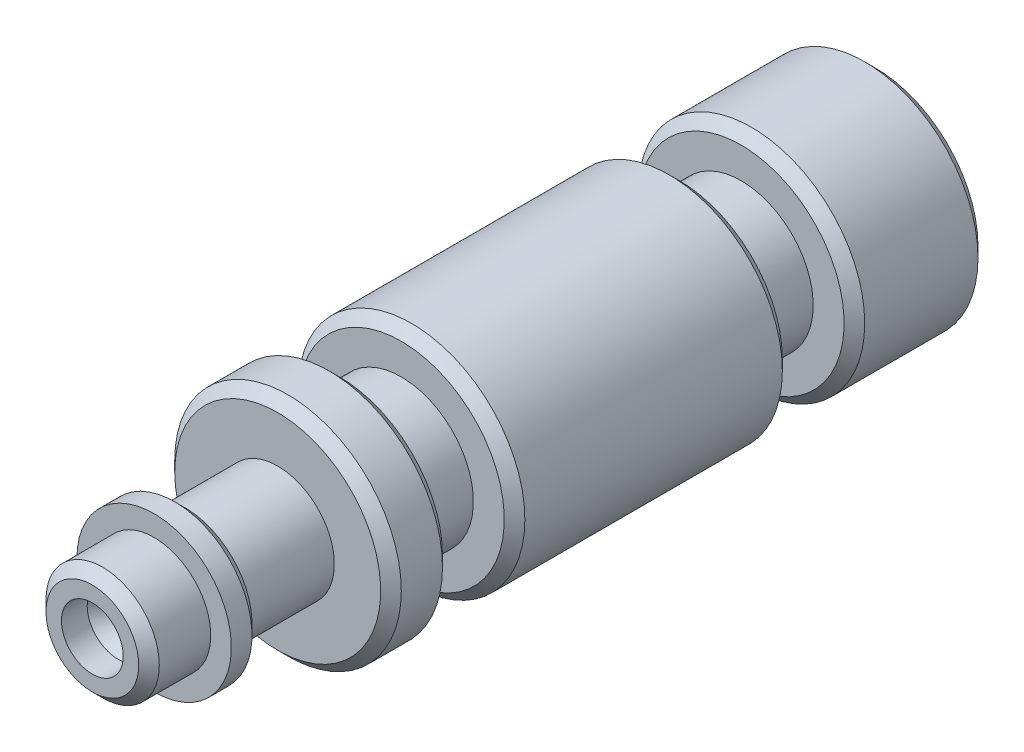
ISO-10303-21;
HEADER;
FILE_DESCRIPTION(('STEP AP214'),'2;1');
FILE_NAME('part.step','',(''),(''),'','','');
FILE_SCHEMA(('AUTOMOTIVE_DESIGN { 1 0 10303 214 1 1 1 1 }'));
ENDSEC;
DATA;
#1=APPLICATION_CONTEXT('core data for automotive mechanical design processes');
#2=APPLICATION_PROTOCOL_DEFINITION('international standard','automotive_design',2000,#1);
#3=PRODUCT_CONTEXT('',#1,'mechanical');
#4=PRODUCT('Part','Part','',(#3));
#5=PRODUCT_RELATED_PRODUCT_CATEGORY('part','',(#4));
#6=PRODUCT_DEFINITION_FORMATION('','',#4);
#7=PRODUCT_DEFINITION_CONTEXT('part definition',#1,'design');
#8=PRODUCT_DEFINITION('design','',#6,#7);
#9=PRODUCT_DEFINITION_SHAPE('','',#8);
#10=(LENGTH_UNIT() NAMED_UNIT(*) SI_UNIT(.MILLI.,.METRE.));
#11=(NAMED_UNIT(*) PLANE_ANGLE_UNIT() SI_UNIT($,.RADIAN.));
#12=(NAMED_UNIT(*) SI_UNIT($,.STERADIAN.) SOLID_ANGLE_UNIT());
#13=UNCERTAINTY_MEASURE_WITH_UNIT(LENGTH_MEASURE(1.E-05),#10,'distance_accuracy_value','');
#14=(GEOMETRIC_REPRESENTATION_CONTEXT(3) GLOBAL_UNCERTAINTY_ASSIGNED_CONTEXT((#13)) GLOBAL_UNIT_ASSIGNED_CONTEXT((#10,
#11,#12)) REPRESENTATION_CONTEXT('',''));
#15=CARTESIAN_POINT('',(0.,0.,0.));
#16=DIRECTION('',(0.,0.,1.));
#17=DIRECTION('',(1.,0.,0.));
#18=AXIS2_PLACEMENT_3D('',#15,#16,#17);
#19=CARTESIAN_POINT('',(0.,0.,38.));
#20=DIRECTION('',(0.,0.,-1.));
#21=DIRECTION('',(-1.,0.,0.));
#22=AXIS2_PLACEMENT_3D('',#19,#20,#21);
#23=CYLINDRICAL_SURFACE('',#22,5.5);
#24=CARTESIAN_POINT('',(0.,0.,10.));
#25=DIRECTION('',(0.,0.,1.));
#26=DIRECTION('',(1.,0.,0.));
#27=AXIS2_PLACEMENT_3D('',#24,#25,#26);
#28=CIRCLE('',#27,5.5);
#29=CARTESIAN_POINT('',(5.5,0.,10.));
#30=VERTEX_POINT('',#29);
#31=EDGE_CURVE('E43',#30,#30,#28,.T.);
#32=ORIENTED_EDGE('',*,*,#31,.T.);
#33=EDGE_LOOP('',(#32));
#34=FACE_BOUND('',#33,.T.);
#35=CARTESIAN_POINT('',(0.,0.,22.5));
#36=DIRECTION('',(0.,0.,-1.));
#37=DIRECTION('',(-1.,0.,0.));
#38=AXIS2_PLACEMENT_3D('',#35,#36,#37);
#39=CIRCLE('',#38,5.5);
#40=CARTESIAN_POINT('',(-5.5,0.,22.5));
#41=VERTEX_POINT('',#40);
#42=EDGE_CURVE('E46',#41,#41,#39,.T.);
#43=ORIENTED_EDGE('',*,*,#42,.T.);
#44=EDGE_LOOP('',(#43));
#45=FACE_BOUND('',#44,.T.);
#46=ADVANCED_FACE('F23',(#34,#45),#23,.T.);
#47=CARTESIAN_POINT('',(0.,0.,0.500000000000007));
#48=DIRECTION('',(0.,0.,1.));
#49=DIRECTION('',(1.,0.,0.));
#50=AXIS2_PLACEMENT_3D('',#47,#48,#49);
#51=CIRCLE('',#50,5.5);
#52=CARTESIAN_POINT('',(5.5,0.,0.500000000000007));
#53=VERTEX_POINT('',#52);
#54=EDGE_CURVE('E58',#53,#53,#51,.T.);
#55=ORIENTED_EDGE('',*,*,#54,.T.);
#56=EDGE_LOOP('',(#55));
#57=FACE_BOUND('',#56,.T.);
#58=CARTESIAN_POINT('',(0.,0.,5.99999999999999));
#59=DIRECTION('',(0.,0.,-1.));
#60=DIRECTION('',(-1.,0.,0.));
#61=AXIS2_PLACEMENT_3D('',#58,#59,#60);
#62=CIRCLE('',#61,5.5);
#63=CARTESIAN_POINT('',(-5.5,0.,5.99999999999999));
#64=VERTEX_POINT('',#63);
#65=EDGE_CURVE('E61',#64,#64,#62,.T.);
#66=ORIENTED_EDGE('',*,*,#65,.T.);
#67=EDGE_LOOP('',(#66));
#68=FACE_BOUND('',#67,.T.);
#69=ADVANCED_FACE('F145',(#57,#68),#23,.T.);
#70=CARTESIAN_POINT('',(0.,0.,0.));
#71=DIRECTION('',(0.,0.,1.));
#72=DIRECTION('',(1.,0.,0.));
#73=AXIS2_PLACEMENT_3D('',#70,#71,#72);
#74=PLANE('',#73);
#75=CARTESIAN_POINT('',(0.,0.,0.));
#76=DIRECTION('',(0.,0.,1.));
#77=DIRECTION('',(1.,0.,0.));
#78=AXIS2_PLACEMENT_3D('',#75,#76,#77);
#79=CIRCLE('',#78,5.);
#80=CARTESIAN_POINT('',(5.,0.,0.));
#81=VERTEX_POINT('',#80);
#82=EDGE_CURVE('E55',#81,#81,#79,.F.);
#83=ORIENTED_EDGE('',*,*,#82,.T.);
#84=EDGE_LOOP('',(#83));
#85=FACE_BOUND('',#84,.T.);
#86=CARTESIAN_POINT('',(0.,0.,0.));
#87=DIRECTION('',(0.,0.,-1.));
#88=DIRECTION('',(-1.,0.,0.));
#89=AXIS2_PLACEMENT_3D('',#86,#87,#88);
#90=CIRCLE('',#89,4.5);
#91=CARTESIAN_POINT('',(-4.5,0.,0.));
#92=VERTEX_POINT('',#91);
#93=EDGE_CURVE('E76',#92,#92,#90,.T.);
#94=ORIENTED_EDGE('',*,*,#93,.F.);
#95=EDGE_LOOP('',(#94));
#96=FACE_BOUND('',#95,.T.);
#97=ADVANCED_FACE('F151',(#85,#96),#74,.F.);
#98=CARTESIAN_POINT('',(0.,0.,3.));
#99=DIRECTION('',(0.,0.,-1.));
#100=DIRECTION('',(0.,1.,0.));
#101=AXIS2_PLACEMENT_3D('',#98,#99,#100);
#102=SPHERICAL_SURFACE('',#101,3.);
#103=CARTESIAN_POINT('',(0.,0.,5.15525339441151));
#104=DIRECTION('',(0.,0.,-1.));
#105=DIRECTION('',(-1.,0.,0.));
#106=AXIS2_PLACEMENT_3D('',#103,#104,#105);
#107=CIRCLE('',#106,2.08683559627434);
#108=CARTESIAN_POINT('',(-2.08683559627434,0.,5.15525339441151));
#109=VERTEX_POINT('',#108);
#110=EDGE_CURVE('E73',#109,#109,#107,.T.);
#111=ORIENTED_EDGE('',*,*,#110,.T.);
#112=EDGE_LOOP('',(#111));
#113=FACE_BOUND('',#112,.T.);
#114=ADVANCED_FACE('F209',(#113),#102,.F.);
#115=CARTESIAN_POINT('',(0.,0.,-0.592088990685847));
#116=DIRECTION('',(0.,0.,-1.));
#117=DIRECTION('',(-1.,0.,0.));
#118=AXIS2_PLACEMENT_3D('',#115,#116,#117);
#119=DEGENERATE_TOROIDAL_SURFACE('',#118,3.4780593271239,8.,.F.);
#120=ORIENTED_EDGE('',*,*,#110,.F.);
#121=EDGE_LOOP('',(#120));
#122=FACE_BOUND('',#121,.T.);
#123=ORIENTED_EDGE('',*,*,#93,.T.);
#124=EDGE_LOOP('',(#123));
#125=FACE_BOUND('',#124,.T.);
#126=ADVANCED_FACE('F205',(#122,#125),#119,.T.);
#127=CARTESIAN_POINT('',(0.,5.5,6.5));
#128=DIRECTION('',(0.,0.,-1.));
#129=DIRECTION('',(-1.,0.,0.));
#130=AXIS2_PLACEMENT_3D('',#127,#128,#129);
#131=PLANE('',#130);
#132=CARTESIAN_POINT('',(0.,0.,6.5));
#133=DIRECTION('',(0.,0.,-1.));
#134=DIRECTION('',(-1.,0.,0.));
#135=AXIS2_PLACEMENT_3D('',#132,#133,#134);
#136=CIRCLE('',#135,4.99999999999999);
#137=CARTESIAN_POINT('',(-4.99999999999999,0.,6.5));
#138=VERTEX_POINT('',#137);
#139=EDGE_CURVE('E52',#138,#138,#136,.F.);
#140=ORIENTED_EDGE('',*,*,#139,.T.);
#141=EDGE_LOOP('',(#140));
#142=FACE_BOUND('',#141,.T.);
#143=CARTESIAN_POINT('',(0.,0.,6.5));
#144=DIRECTION('',(0.,0.,-1.));
#145=DIRECTION('',(-1.,0.,0.));
#146=AXIS2_PLACEMENT_3D('',#143,#144,#145);
#147=CIRCLE('',#146,3.5);
#148=CARTESIAN_POINT('',(-3.5,0.,6.5));
#149=VERTEX_POINT('',#148);
#150=EDGE_CURVE('E79',#149,#149,#147,.T.);
#151=ORIENTED_EDGE('',*,*,#150,.T.);
#152=EDGE_LOOP('',(#151));
#153=FACE_BOUND('',#152,.T.);
#154=ADVANCED_FACE('F201',(#142,#153),#131,.F.);
#155=CARTESIAN_POINT('',(0.,0.,0.));
#156=DIRECTION('',(0.,0.,-1.));
#157=DIRECTION('',(-1.,0.,0.));
#158=AXIS2_PLACEMENT_3D('',#155,#156,#157);
#159=CYLINDRICAL_SURFACE('',#158,3.5);
#160=ORIENTED_EDGE('',*,*,#150,.F.);
#161=EDGE_LOOP('',(#160));
#162=FACE_BOUND('',#161,.T.);
#163=CARTESIAN_POINT('',(0.,0.,9.5));
#164=DIRECTION('',(0.,0.,-1.));
#165=DIRECTION('',(-1.,0.,0.));
#166=AXIS2_PLACEMENT_3D('',#163,#164,#165);
#167=CIRCLE('',#166,3.5);
#168=CARTESIAN_POINT('',(-3.5,0.,9.5));
#169=VERTEX_POINT('',#168);
#170=EDGE_CURVE('E82',#169,#169,#167,.T.);
#171=ORIENTED_EDGE('',*,*,#170,.T.);
#172=EDGE_LOOP('',(#171));
#173=FACE_BOUND('',#172,.T.);
#174=ADVANCED_FACE('F197',(#162,#173),#159,.T.);
#175=CARTESIAN_POINT('',(0.,5.5,9.5));
#176=DIRECTION('',(0.,0.,1.));
#177=DIRECTION('',(1.,0.,0.));
#178=AXIS2_PLACEMENT_3D('',#175,#176,#177);
#179=PLANE('',#178);
#180=CARTESIAN_POINT('',(0.,0.,9.5));
#181=DIRECTION('',(0.,0.,1.));
#182=DIRECTION('',(1.,0.,0.));
#183=AXIS2_PLACEMENT_3D('',#180,#181,#182);
#184=CIRCLE('',#183,4.99999999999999);
#185=CARTESIAN_POINT('',(4.99999999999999,0.,9.5));
#186=VERTEX_POINT('',#185);
#187=EDGE_CURVE('E49',#186,#186,#184,.F.);
#188=ORIENTED_EDGE('',*,*,#187,.T.);
#189=EDGE_LOOP('',(#188));
#190=FACE_BOUND('',#189,.T.);
#191=ORIENTED_EDGE('',*,*,#170,.F.);
#192=EDGE_LOOP('',(#191));
#193=FACE_BOUND('',#192,.T.);
#194=ADVANCED_FACE('F190',(#190,#193),#179,.F.);
#195=CARTESIAN_POINT('',(0.,5.5,23.));
#196=DIRECTION('',(0.,0.,-1.));
#197=DIRECTION('',(-1.,0.,0.));
#198=AXIS2_PLACEMENT_3D('',#195,#196,#197);
#199=PLANE('',#198);
#200=CARTESIAN_POINT('',(0.,0.,23.));
#201=DIRECTION('',(0.,0.,-1.));
#202=DIRECTION('',(-1.,0.,0.));
#203=AXIS2_PLACEMENT_3D('',#200,#201,#202);
#204=CIRCLE('',#203,5.);
#205=CARTESIAN_POINT('',(-5.,0.,23.));
#206=VERTEX_POINT('',#205);
#207=EDGE_CURVE('E38',#206,#206,#204,.F.);
#208=ORIENTED_EDGE('',*,*,#207,.T.);
#209=EDGE_LOOP('',(#208));
#210=FACE_BOUND('',#209,.T.);
#211=CARTESIAN_POINT('',(0.,0.,23.));
#212=DIRECTION('',(0.,0.,-1.));
#213=DIRECTION('',(-1.,0.,0.));
#214=AXIS2_PLACEMENT_3D('',#211,#212,#213);
#215=CIRCLE('',#214,3.5);
#216=CARTESIAN_POINT('',(-3.5,0.,23.));
#217=VERTEX_POINT('',#216);
#218=EDGE_CURVE('E85',#217,#217,#215,.T.);
#219=ORIENTED_EDGE('',*,*,#218,.T.);
#220=EDGE_LOOP('',(#219));
#221=FACE_BOUND('',#220,.T.);
#222=ADVANCED_FACE('F184',(#210,#221),#199,.F.);
#223=CARTESIAN_POINT('',(0.,0.,0.));
#224=DIRECTION('',(0.,0.,-1.));
#225=DIRECTION('',(-1.,0.,0.));
#226=AXIS2_PLACEMENT_3D('',#223,#224,#225);
#227=CYLINDRICAL_SURFACE('',#226,3.5);
#228=ORIENTED_EDGE('',*,*,#218,.F.);
#229=EDGE_LOOP('',(#228));
#230=FACE_BOUND('',#229,.T.);
#231=CARTESIAN_POINT('',(0.,0.,26.));
#232=DIRECTION('',(0.,0.,-1.));
#233=DIRECTION('',(-1.,0.,0.));
#234=AXIS2_PLACEMENT_3D('',#231,#232,#233);
#235=CIRCLE('',#234,3.5);
#236=CARTESIAN_POINT('',(-3.5,0.,26.));
#237=VERTEX_POINT('',#236);
#238=EDGE_CURVE('E88',#237,#237,#235,.T.);
#239=ORIENTED_EDGE('',*,*,#238,.T.);
#240=EDGE_LOOP('',(#239));
#241=FACE_BOUND('',#240,.T.);
#242=ADVANCED_FACE('F166',(#230,#241),#227,.T.);
#243=CARTESIAN_POINT('',(0.,5.5,26.));
#244=DIRECTION('',(0.,0.,1.));
#245=DIRECTION('',(1.,0.,0.));
#246=AXIS2_PLACEMENT_3D('',#243,#244,#245);
#247=PLANE('',#246);
#248=CARTESIAN_POINT('',(0.,0.,26.));
#249=DIRECTION('',(0.,0.,1.));
#250=DIRECTION('',(1.,0.,0.));
#251=AXIS2_PLACEMENT_3D('',#248,#249,#250);
#252=CIRCLE('',#251,4.99999999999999);
#253=CARTESIAN_POINT('',(4.99999999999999,0.,26.));
#254=VERTEX_POINT('',#253);
#255=EDGE_CURVE('E34',#254,#254,#252,.F.);
#256=ORIENTED_EDGE('',*,*,#255,.T.);
#257=EDGE_LOOP('',(#256));
#258=FACE_BOUND('',#257,.T.);
#259=ORIENTED_EDGE('',*,*,#238,.F.);
#260=EDGE_LOOP('',(#259));
#261=FACE_BOUND('',#260,.T.);
#262=ADVANCED_FACE('F156',(#258,#261),#247,.F.);
#263=CARTESIAN_POINT('',(0.,0.,28.5));
#264=DIRECTION('',(0.,0.,-1.));
#265=DIRECTION('',(-1.,0.,0.));
#266=AXIS2_PLACEMENT_3D('',#263,#264,#265);
#267=CIRCLE('',#266,5.5);
#268=CARTESIAN_POINT('',(-5.5,0.,28.5));
#269=VERTEX_POINT('',#268);
#270=EDGE_CURVE('E67',#269,#269,#267,.T.);
#271=ORIENTED_EDGE('',*,*,#270,.T.);
#272=EDGE_LOOP('',(#271));
#273=FACE_BOUND('',#272,.T.);
#274=CARTESIAN_POINT('',(0.,0.,26.5));
#275=DIRECTION('',(0.,0.,1.));
#276=DIRECTION('',(1.,0.,0.));
#277=AXIS2_PLACEMENT_3D('',#274,#275,#276);
#278=CIRCLE('',#277,5.5);
#279=CARTESIAN_POINT('',(5.5,0.,26.5));
#280=VERTEX_POINT('',#279);
#281=EDGE_CURVE('E70',#280,#280,#278,.T.);
#282=ORIENTED_EDGE('',*,*,#281,.T.);
#283=EDGE_LOOP('',(#282));
#284=FACE_BOUND('',#283,.T.);
#285=ADVANCED_FACE('F25',(#273,#284),#23,.T.);
#286=CARTESIAN_POINT('',(0.,5.5,29.));
#287=DIRECTION('',(0.,0.,-1.));
#288=DIRECTION('',(-1.,0.,0.));
#289=AXIS2_PLACEMENT_3D('',#286,#287,#288);
#290=PLANE('',#289);
#291=CARTESIAN_POINT('',(0.,0.,29.));
#292=DIRECTION('',(0.,0.,-1.));
#293=DIRECTION('',(-1.,0.,0.));
#294=AXIS2_PLACEMENT_3D('',#291,#292,#293);
#295=CIRCLE('',#294,5.);
#296=CARTESIAN_POINT('',(-5.,0.,29.));
#297=VERTEX_POINT('',#296);
#298=EDGE_CURVE('E64',#297,#297,#295,.F.);
#299=ORIENTED_EDGE('',*,*,#298,.T.);
#300=EDGE_LOOP('',(#299));
#301=FACE_BOUND('',#300,.T.);
#302=CARTESIAN_POINT('',(0.,0.,29.));
#303=DIRECTION('',(0.,0.,-1.));
#304=DIRECTION('',(-1.,0.,0.));
#305=AXIS2_PLACEMENT_3D('',#302,#303,#304);
#306=CIRCLE('',#305,2.75);
#307=CARTESIAN_POINT('',(-2.75,0.,29.));
#308=VERTEX_POINT('',#307);
#309=EDGE_CURVE('E91',#308,#308,#306,.T.);
#310=ORIENTED_EDGE('',*,*,#309,.T.);
#311=EDGE_LOOP('',(#310));
#312=FACE_BOUND('',#311,.T.);
#313=ADVANCED_FACE('F155',(#301,#312),#290,.F.);
#314=CARTESIAN_POINT('',(0.,0.,0.));
#315=DIRECTION('',(0.,0.,-1.));
#316=DIRECTION('',(-1.,0.,0.));
#317=AXIS2_PLACEMENT_3D('',#314,#315,#316);
#318=CYLINDRICAL_SURFACE('',#317,2.75);
#319=ORIENTED_EDGE('',*,*,#309,.F.);
#320=EDGE_LOOP('',(#319));
#321=FACE_BOUND('',#320,.T.);
#322=CARTESIAN_POINT('',(0.,0.,33.5));
#323=DIRECTION('',(0.,0.,-1.));
#324=DIRECTION('',(-1.,0.,0.));
#325=AXIS2_PLACEMENT_3D('',#322,#323,#324);
#326=CIRCLE('',#325,2.75);
#327=CARTESIAN_POINT('',(-2.75,0.,33.5));
#328=VERTEX_POINT('',#327);
#329=EDGE_CURVE('E94',#328,#328,#326,.T.);
#330=ORIENTED_EDGE('',*,*,#329,.T.);
#331=EDGE_LOOP('',(#330));
#332=FACE_BOUND('',#331,.T.);
#333=ADVANCED_FACE('F162',(#321,#332),#318,.T.);
#334=CARTESIAN_POINT('',(0.,2.75,33.5));
#335=DIRECTION('',(0.,0.,1.));
#336=DIRECTION('',(1.,0.,0.));
#337=AXIS2_PLACEMENT_3D('',#334,#335,#336);
#338=PLANE('',#337);
#339=ORIENTED_EDGE('',*,*,#329,.F.);
#340=EDGE_LOOP('',(#339));
#341=FACE_BOUND('',#340,.T.);
#342=CARTESIAN_POINT('',(0.,0.,33.5));
#343=DIRECTION('',(0.,0.,-1.));
#344=DIRECTION('',(-1.,0.,0.));
#345=AXIS2_PLACEMENT_3D('',#342,#343,#344);
#346=CIRCLE('',#345,3.24999999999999);
#347=CARTESIAN_POINT('',(-3.24999999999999,0.,33.5));
#348=VERTEX_POINT('',#347);
#349=EDGE_CURVE('E97',#348,#348,#346,.T.);
#350=ORIENTED_EDGE('',*,*,#349,.T.);
#351=EDGE_LOOP('',(#350));
#352=FACE_BOUND('',#351,.T.);
#353=ADVANCED_FACE('F234',(#341,#352),#338,.F.);
#354=CARTESIAN_POINT('',(0.,0.,34.));
#355=DIRECTION('',(0.,0.,1.));
#356=DIRECTION('',(1.,0.,0.));
#357=AXIS2_PLACEMENT_3D('',#354,#355,#356);
#358=CONICAL_SURFACE('',#357,3.75,0.785398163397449);
#359=ORIENTED_EDGE('',*,*,#349,.F.);
#360=EDGE_LOOP('',(#359));
#361=FACE_BOUND('',#360,.T.);
#362=CARTESIAN_POINT('',(0.,0.,34.));
#363=DIRECTION('',(0.,0.,-1.));
#364=DIRECTION('',(-1.,0.,0.));
#365=AXIS2_PLACEMENT_3D('',#362,#363,#364);
#366=CIRCLE('',#365,3.75);
#367=CARTESIAN_POINT('',(-3.75,0.,34.));
#368=VERTEX_POINT('',#367);
#369=EDGE_CURVE('E100',#368,#368,#366,.T.);
#370=ORIENTED_EDGE('',*,*,#369,.T.);
#371=EDGE_LOOP('',(#370));
#372=FACE_BOUND('',#371,.T.);
#373=ADVANCED_FACE('F230',(#361,#372),#358,.T.);
#374=CARTESIAN_POINT('',(0.,0.,0.));
#375=DIRECTION('',(0.,0.,-1.));
#376=DIRECTION('',(-1.,0.,0.));
#377=AXIS2_PLACEMENT_3D('',#374,#375,#376);
#378=CYLINDRICAL_SURFACE('',#377,3.75);
#379=ORIENTED_EDGE('',*,*,#369,.F.);
#380=EDGE_LOOP('',(#379));
#381=FACE_BOUND('',#380,.T.);
#382=CARTESIAN_POINT('',(0.,0.,35.));
#383=DIRECTION('',(0.,0.,-1.));
#384=DIRECTION('',(-1.,0.,0.));
#385=AXIS2_PLACEMENT_3D('',#382,#383,#384);
#386=CIRCLE('',#385,3.75);
#387=CARTESIAN_POINT('',(-3.75,0.,35.));
#388=VERTEX_POINT('',#387);
#389=EDGE_CURVE('E103',#388,#388,#386,.T.);
#390=ORIENTED_EDGE('',*,*,#389,.T.);
#391=EDGE_LOOP('',(#390));
#392=FACE_BOUND('',#391,.T.);
#393=ADVANCED_FACE('F223',(#381,#392),#378,.T.);
#394=CARTESIAN_POINT('',(0.,2.75,35.));
#395=DIRECTION('',(0.,0.,-1.));
#396=DIRECTION('',(-1.,0.,0.));
#397=AXIS2_PLACEMENT_3D('',#394,#395,#396);
#398=PLANE('',#397);
#399=ORIENTED_EDGE('',*,*,#389,.F.);
#400=EDGE_LOOP('',(#399));
#401=FACE_BOUND('',#400,.T.);
#402=CARTESIAN_POINT('',(0.,0.,35.));
#403=DIRECTION('',(0.,0.,-1.));
#404=DIRECTION('',(-1.,0.,0.));
#405=AXIS2_PLACEMENT_3D('',#402,#403,#404);
#406=CIRCLE('',#405,2.75);
#407=CARTESIAN_POINT('',(-2.75,0.,35.));
#408=VERTEX_POINT('',#407);
#409=EDGE_CURVE('E106',#408,#408,#406,.T.);
#410=ORIENTED_EDGE('',*,*,#409,.T.);
#411=EDGE_LOOP('',(#410));
#412=FACE_BOUND('',#411,.T.);
#413=ADVANCED_FACE('F219',(#401,#412),#398,.F.);
#414=CARTESIAN_POINT('',(0.,0.,0.));
#415=DIRECTION('',(0.,0.,-1.));
#416=DIRECTION('',(-1.,0.,0.));
#417=AXIS2_PLACEMENT_3D('',#414,#415,#416);
#418=CYLINDRICAL_SURFACE('',#417,2.75);
#419=CARTESIAN_POINT('',(0.,0.,37.5));
#420=DIRECTION('',(0.,0.,1.));
#421=DIRECTION('',(1.,0.,0.));
#422=AXIS2_PLACEMENT_3D('',#419,#420,#421);
#423=CIRCLE('',#422,2.75);
#424=CARTESIAN_POINT('',(2.75,0.,37.5));
#425=VERTEX_POINT('',#424);
#426=EDGE_CURVE('E30',#425,#425,#423,.F.);
#427=ORIENTED_EDGE('',*,*,#426,.T.);
#428=EDGE_LOOP('',(#427));
#429=FACE_BOUND('',#428,.T.);
#430=ORIENTED_EDGE('',*,*,#409,.F.);
#431=EDGE_LOOP('',(#430));
#432=FACE_BOUND('',#431,.T.);
#433=ADVANCED_FACE('F215',(#429,#432),#418,.T.);
#434=CARTESIAN_POINT('',(0.,0.,38.));
#435=DIRECTION('',(0.,0.,1.));
#436=DIRECTION('',(1.,0.,0.));
#437=AXIS2_PLACEMENT_3D('',#434,#435,#436);
#438=PLANE('',#437);
#439=CARTESIAN_POINT('',(0.,0.,38.));
#440=DIRECTION('',(0.,0.,1.));
#441=DIRECTION('',(1.,0.,0.));
#442=AXIS2_PLACEMENT_3D('',#439,#440,#441);
#443=CIRCLE('',#442,2.24999999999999);
#444=CARTESIAN_POINT('',(2.24999999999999,0.,38.));
#445=VERTEX_POINT('',#444);
#446=EDGE_CURVE('E11',#445,#445,#443,.T.);
#447=ORIENTED_EDGE('',*,*,#446,.T.);
#448=EDGE_LOOP('',(#447));
#449=FACE_BOUND('',#448,.T.);
#450=CARTESIAN_POINT('',(0.,0.,38.));
#451=DIRECTION('',(0.,0.,-1.));
#452=DIRECTION('',(-1.,0.,0.));
#453=AXIS2_PLACEMENT_3D('',#450,#451,#452);
#454=CIRCLE('',#453,1.49999999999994);
#455=CARTESIAN_POINT('',(-1.49999999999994,0.,38.));
#456=VERTEX_POINT('',#455);
#457=EDGE_CURVE('E115',#456,#456,#454,.T.);
#458=ORIENTED_EDGE('',*,*,#457,.T.);
#459=EDGE_LOOP('',(#458));
#460=FACE_BOUND('',#459,.T.);
#461=ADVANCED_FACE('F119',(#449,#460),#438,.T.);
#462=CARTESIAN_POINT('',(0.,0.,0.));
#463=DIRECTION('',(0.,0.,-1.));
#464=DIRECTION('',(-1.,0.,0.));
#465=AXIS2_PLACEMENT_3D('',#462,#463,#464);
#466=CYLINDRICAL_SURFACE('',#465,1.49999999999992);
#467=ORIENTED_EDGE('',*,*,#457,.F.);
#468=EDGE_LOOP('',(#467));
#469=FACE_BOUND('',#468,.T.);
#470=CARTESIAN_POINT('',(0.,0.,36.75));
#471=DIRECTION('',(0.,0.,-1.));
#472=DIRECTION('',(-1.,0.,0.));
#473=AXIS2_PLACEMENT_3D('',#470,#471,#472);
#474=CIRCLE('',#473,1.49999999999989);
#475=CARTESIAN_POINT('',(-1.49999999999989,0.,36.75));
#476=VERTEX_POINT('',#475);
#477=EDGE_CURVE('E112',#476,#476,#474,.T.);
#478=ORIENTED_EDGE('',*,*,#477,.T.);
#479=EDGE_LOOP('',(#478));
#480=FACE_BOUND('',#479,.T.);
#481=ADVANCED_FACE('F121',(#469,#480),#466,.F.);
#482=CARTESIAN_POINT('',(0.,0.,35.5));
#483=DIRECTION('',(0.,0.,1.));
#484=DIRECTION('',(1.,0.,0.));
#485=AXIS2_PLACEMENT_3D('',#482,#483,#484);
#486=CONICAL_SURFACE('',#485,0.749999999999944,0.540419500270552);
#487=ORIENTED_EDGE('',*,*,#477,.F.);
#488=EDGE_LOOP('',(#487));
#489=FACE_BOUND('',#488,.T.);
#490=CARTESIAN_POINT('',(0.,0.,35.5));
#491=DIRECTION('',(0.,0.,-1.));
#492=DIRECTION('',(-1.,0.,0.));
#493=AXIS2_PLACEMENT_3D('',#490,#491,#492);
#494=CIRCLE('',#493,0.749999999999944);
#495=CARTESIAN_POINT('',(-0.749999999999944,0.,35.5));
#496=VERTEX_POINT('',#495);
#497=EDGE_CURVE('E109',#496,#496,#494,.T.);
#498=ORIENTED_EDGE('',*,*,#497,.T.);
#499=EDGE_LOOP('',(#498));
#500=FACE_BOUND('',#499,.T.);
#501=ADVANCED_FACE('F124',(#489,#500),#486,.F.);
#502=CARTESIAN_POINT('',(0.,0.,35.5));
#503=DIRECTION('',(0.,0.,-1.));
#504=DIRECTION('',(-1.,0.,0.));
#505=AXIS2_PLACEMENT_3D('',#502,#503,#504);
#506=PLANE('',#505);
#507=ORIENTED_EDGE('',*,*,#497,.F.);
#508=EDGE_LOOP('',(#507));
#509=FACE_BOUND('',#508,.T.);
#510=ADVANCED_FACE('F130',(#509),#506,.F.);
#511=CARTESIAN_POINT('',(0.,0.,28.5));
#512=DIRECTION('',(0.,0.,-1.));
#513=DIRECTION('',(-1.,0.,0.));
#514=AXIS2_PLACEMENT_3D('',#511,#512,#513);
#515=CONICAL_SURFACE('',#514,5.5,0.785398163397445);
#516=ORIENTED_EDGE('',*,*,#298,.F.);
#517=EDGE_LOOP('',(#516));
#518=FACE_BOUND('',#517,.T.);
#519=ORIENTED_EDGE('',*,*,#270,.F.);
#520=EDGE_LOOP('',(#519));
#521=FACE_BOUND('',#520,.T.);
#522=ADVANCED_FACE('F135',(#518,#521),#515,.T.);
#523=CARTESIAN_POINT('',(0.,0.,0.500000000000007));
#524=DIRECTION('',(0.,0.,1.));
#525=DIRECTION('',(1.,0.,0.));
#526=AXIS2_PLACEMENT_3D('',#523,#524,#525);
#527=CONICAL_SURFACE('',#526,5.5,0.785398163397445);
#528=ORIENTED_EDGE('',*,*,#82,.F.);
#529=EDGE_LOOP('',(#528));
#530=FACE_BOUND('',#529,.T.);
#531=ORIENTED_EDGE('',*,*,#54,.F.);
#532=EDGE_LOOP('',(#531));
#533=FACE_BOUND('',#532,.T.);
#534=ADVANCED_FACE('F140',(#530,#533),#527,.T.);
#535=CARTESIAN_POINT('',(0.,0.,5.99999999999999));
#536=DIRECTION('',(0.,0.,-1.));
#537=DIRECTION('',(-1.,0.,0.));
#538=AXIS2_PLACEMENT_3D('',#535,#536,#537);
#539=CONICAL_SURFACE('',#538,5.5,0.785398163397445);
#540=ORIENTED_EDGE('',*,*,#139,.F.);
#541=EDGE_LOOP('',(#540));
#542=FACE_BOUND('',#541,.T.);
#543=ORIENTED_EDGE('',*,*,#65,.F.);
#544=EDGE_LOOP('',(#543));
#545=FACE_BOUND('',#544,.T.);
#546=ADVANCED_FACE('F282',(#542,#545),#539,.T.);
#547=CARTESIAN_POINT('',(0.,0.,9.5));
#548=DIRECTION('',(0.,0.,1.));
#549=DIRECTION('',(1.,0.,0.));
#550=AXIS2_PLACEMENT_3D('',#547,#548,#549);
#551=CONICAL_SURFACE('',#550,4.99999999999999,0.785398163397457);
#552=ORIENTED_EDGE('',*,*,#31,.F.);
#553=EDGE_LOOP('',(#552));
#554=FACE_BOUND('',#553,.T.);
#555=ORIENTED_EDGE('',*,*,#187,.F.);
#556=EDGE_LOOP('',(#555));
#557=FACE_BOUND('',#556,.T.);
#558=ADVANCED_FACE('F289',(#554,#557),#551,.T.);
#559=CARTESIAN_POINT('',(0.,0.,22.5));
#560=DIRECTION('',(0.,0.,-1.));
#561=DIRECTION('',(-1.,0.,0.));
#562=AXIS2_PLACEMENT_3D('',#559,#560,#561);
#563=CONICAL_SURFACE('',#562,5.5,0.785398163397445);
#564=ORIENTED_EDGE('',*,*,#207,.F.);
#565=EDGE_LOOP('',(#564));
#566=FACE_BOUND('',#565,.T.);
#567=ORIENTED_EDGE('',*,*,#42,.F.);
#568=EDGE_LOOP('',(#567));
#569=FACE_BOUND('',#568,.T.);
#570=ADVANCED_FACE('F177',(#566,#569),#563,.T.);
#571=CARTESIAN_POINT('',(0.,0.,26.));
#572=DIRECTION('',(0.,0.,1.));
#573=DIRECTION('',(1.,0.,0.));
#574=AXIS2_PLACEMENT_3D('',#571,#572,#573);
#575=CONICAL_SURFACE('',#574,4.99999999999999,0.785398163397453);
#576=ORIENTED_EDGE('',*,*,#281,.F.);
#577=EDGE_LOOP('',(#576));
#578=FACE_BOUND('',#577,.T.);
#579=ORIENTED_EDGE('',*,*,#255,.F.);
#580=EDGE_LOOP('',(#579));
#581=FACE_BOUND('',#580,.T.);
#582=ADVANCED_FACE('F173',(#578,#581),#575,.T.);
#583=CARTESIAN_POINT('',(0.,0.,37.5));
#584=DIRECTION('',(0.,0.,-1.));
#585=DIRECTION('',(-1.,0.,0.));
#586=AXIS2_PLACEMENT_3D('',#583,#584,#585);
#587=CONICAL_SURFACE('',#586,2.75,0.785398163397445);
#588=ORIENTED_EDGE('',*,*,#446,.F.);
#589=EDGE_LOOP('',(#588));
#590=FACE_BOUND('',#589,.T.);
#591=ORIENTED_EDGE('',*,*,#426,.F.);
#592=EDGE_LOOP('',(#591));
#593=FACE_BOUND('',#592,.T.);
#594=ADVANCED_FACE('F176',(#590,#593),#587,.T.);
#595=CLOSED_SHELL('',(#46,#69,#97,#114,#126,#154,#174,#194,#222,#242,#262,#285,#313,#333,#353,
#373,#393,#413,#433,#461,#481,#501,#510,#522,#534,#546,#558,#570,#582,#594));
#596=MANIFOLD_SOLID_BREP('B2',#595);
#597=ADVANCED_BREP_SHAPE_REPRESENTATION('',(#18,#596),#14);
#598=SHAPE_DEFINITION_REPRESENTATION(#9,#597);
ENDSEC;
END-ISO-10303-21;
